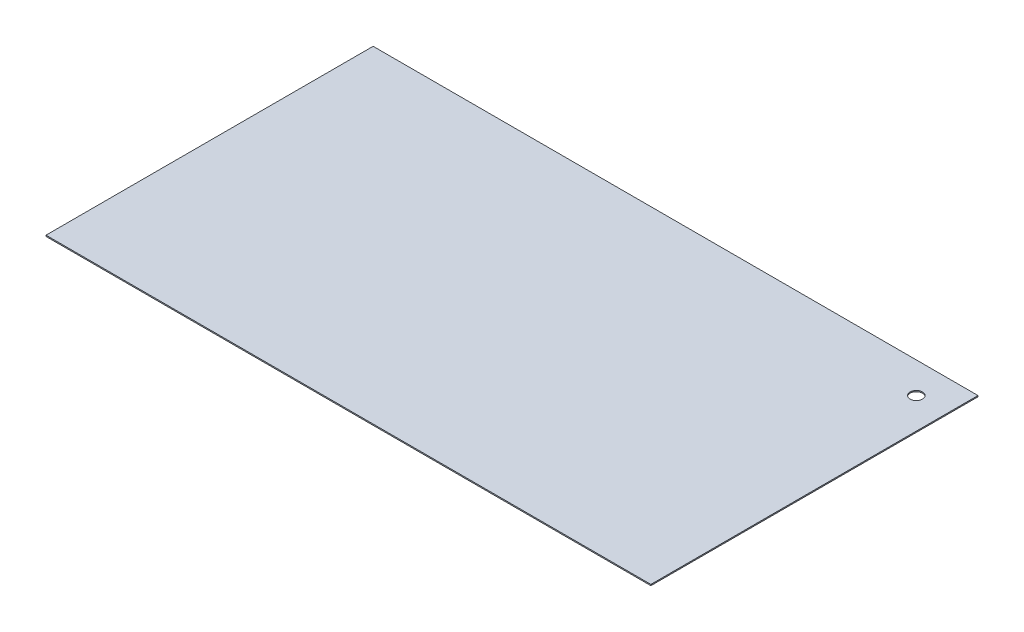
from build123d import *

# Parameters (mm, degrees)
SKETCH1_W                 = 4978.4
SKETCH1_H                 = 2692.4
EXTRUDE1_DEPTH            = 9.525
F_4_CLEARANCE_HOLE1_D     = 102.39248
F_4_CLEARANCE_HOLE1_DEPTH = 9.525
F_4_CLEARANCE_HOLE1_TIP   = 30.761804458


with BuildPart() as part:
    # Sketch1 → Extrude1 (new body)
    with BuildSketch(Plane(origin=(0, 0, 0), x_dir=(1, 0, 0), z_dir=(0, 1, 0))):
        with Locations((2489.2, 1346.2)):
            Rectangle(SKETCH1_W, SKETCH1_H)
    extrude(amount=EXTRUDE1_DEPTH)

    # 4 Clearance Hole1
    with Locations(Plane(origin=(0, 9.525, 0), x_dir=(-1, 0, 0), z_dir=(0, 1, 0))):
        with Locations((-4724.4, -2438.4)):
            Hole(F_4_CLEARANCE_HOLE1_D / 2, depth=F_4_CLEARANCE_HOLE1_DEPTH)
            with Locations((0, 0, -(F_4_CLEARANCE_HOLE1_DEPTH + F_4_CLEARANCE_HOLE1_TIP / 2))):  # 118° drill point
                Cone(0, F_4_CLEARANCE_HOLE1_D / 2, F_4_CLEARANCE_HOLE1_TIP, mode=Mode.SUBTRACT)


solid = part.part
